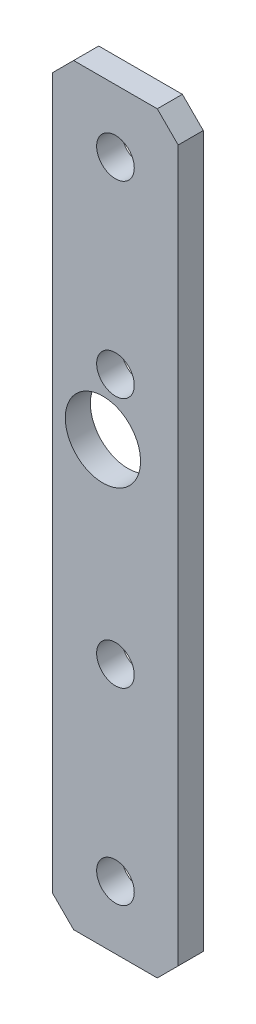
ISO-10303-21;
HEADER;
FILE_DESCRIPTION(('STEP AP214'),'2;1');
FILE_NAME('part.step','',(''),(''),'','','');
FILE_SCHEMA(('AUTOMOTIVE_DESIGN { 1 0 10303 214 1 1 1 1 }'));
ENDSEC;
DATA;
#1=APPLICATION_CONTEXT('core data for automotive mechanical design processes');
#2=APPLICATION_PROTOCOL_DEFINITION('international standard','automotive_design',2000,#1);
#3=PRODUCT_CONTEXT('',#1,'mechanical');
#4=PRODUCT('Part','Part','',(#3));
#5=PRODUCT_RELATED_PRODUCT_CATEGORY('part','',(#4));
#6=PRODUCT_DEFINITION_FORMATION('','',#4);
#7=PRODUCT_DEFINITION_CONTEXT('part definition',#1,'design');
#8=PRODUCT_DEFINITION('design','',#6,#7);
#9=PRODUCT_DEFINITION_SHAPE('','',#8);
#10=(LENGTH_UNIT() NAMED_UNIT(*) SI_UNIT(.MILLI.,.METRE.));
#11=(NAMED_UNIT(*) PLANE_ANGLE_UNIT() SI_UNIT($,.RADIAN.));
#12=(NAMED_UNIT(*) SI_UNIT($,.STERADIAN.) SOLID_ANGLE_UNIT());
#13=UNCERTAINTY_MEASURE_WITH_UNIT(LENGTH_MEASURE(1.E-05),#10,'distance_accuracy_value','');
#14=(GEOMETRIC_REPRESENTATION_CONTEXT(3) GLOBAL_UNCERTAINTY_ASSIGNED_CONTEXT((#13)) GLOBAL_UNIT_ASSIGNED_CONTEXT((#10,
#11,#12)) REPRESENTATION_CONTEXT('',''));
#15=CARTESIAN_POINT('',(0.,0.,0.));
#16=DIRECTION('',(0.,0.,1.));
#17=DIRECTION('',(1.,0.,0.));
#18=AXIS2_PLACEMENT_3D('',#15,#16,#17);
#19=CARTESIAN_POINT('',(0.,0.,0.));
#20=DIRECTION('',(0.,0.,1.));
#21=DIRECTION('',(1.,0.,0.));
#22=AXIS2_PLACEMENT_3D('',#19,#20,#21);
#23=PLANE('',#22);
#24=DIRECTION('',(0.707106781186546,-0.707106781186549,0.));
#25=VECTOR('',#24,1.);
#26=CARTESIAN_POINT('',(9.99999999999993,66.7961225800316,0.));
#27=LINE('',#26,#25);
#28=CARTESIAN_POINT('',(9.99999999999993,66.7961225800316,0.));
#29=VERTEX_POINT('',#28);
#30=CARTESIAN_POINT('',(15.,61.7961225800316,0.));
#31=VERTEX_POINT('',#30);
#32=EDGE_CURVE('E84',#29,#31,#27,.T.);
#33=ORIENTED_EDGE('',*,*,#32,.T.);
#34=DIRECTION('',(0.,1.,0.));
#35=VECTOR('',#34,1.);
#36=CARTESIAN_POINT('',(14.9999999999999,-113.203877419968,0.));
#37=LINE('',#36,#35);
#38=CARTESIAN_POINT('',(14.9999999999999,-108.203877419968,0.));
#39=VERTEX_POINT('',#38);
#40=EDGE_CURVE('E87',#31,#39,#37,.F.);
#41=ORIENTED_EDGE('',*,*,#40,.T.);
#42=DIRECTION('',(-0.707106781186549,-0.707106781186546,0.));
#43=VECTOR('',#42,1.);
#44=CARTESIAN_POINT('',(14.9999999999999,-108.203877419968,0.));
#45=LINE('',#44,#43);
#46=CARTESIAN_POINT('',(9.9999999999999,-113.203877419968,0.));
#47=VERTEX_POINT('',#46);
#48=EDGE_CURVE('E305',#39,#47,#45,.T.);
#49=ORIENTED_EDGE('',*,*,#48,.T.);
#50=DIRECTION('',(1.,0.,0.));
#51=VECTOR('',#50,1.);
#52=CARTESIAN_POINT('',(14.9999999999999,-113.203877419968,0.));
#53=LINE('',#52,#51);
#54=CARTESIAN_POINT('',(-10.,-113.203877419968,0.));
#55=VERTEX_POINT('',#54);
#56=EDGE_CURVE('E300',#47,#55,#53,.F.);
#57=ORIENTED_EDGE('',*,*,#56,.T.);
#58=DIRECTION('',(-0.707106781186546,0.707106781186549,0.));
#59=VECTOR('',#58,1.);
#60=CARTESIAN_POINT('',(-10.,-113.203877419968,0.));
#61=LINE('',#60,#59);
#62=CARTESIAN_POINT('',(-15.,-108.203877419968,0.));
#63=VERTEX_POINT('',#62);
#64=EDGE_CURVE('E296',#55,#63,#61,.T.);
#65=ORIENTED_EDGE('',*,*,#64,.T.);
#66=DIRECTION('',(0.,1.,0.));
#67=VECTOR('',#66,1.);
#68=CARTESIAN_POINT('',(-15.,66.7961225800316,0.));
#69=LINE('',#68,#67);
#70=CARTESIAN_POINT('',(-15.,61.7961225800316,0.));
#71=VERTEX_POINT('',#70);
#72=EDGE_CURVE('E292',#63,#71,#69,.T.);
#73=ORIENTED_EDGE('',*,*,#72,.T.);
#74=DIRECTION('',(0.707106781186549,0.707106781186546,0.));
#75=VECTOR('',#74,1.);
#76=CARTESIAN_POINT('',(-15.,61.7961225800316,0.));
#77=LINE('',#76,#75);
#78=CARTESIAN_POINT('',(-9.99999999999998,66.7961225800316,0.));
#79=VERTEX_POINT('',#78);
#80=EDGE_CURVE('E287',#71,#79,#77,.T.);
#81=ORIENTED_EDGE('',*,*,#80,.T.);
#82=DIRECTION('',(1.,0.,0.));
#83=VECTOR('',#82,1.);
#84=CARTESIAN_POINT('',(14.9999999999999,66.7961225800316,0.));
#85=LINE('',#84,#83);
#86=EDGE_CURVE('E82',#79,#29,#85,.T.);
#87=ORIENTED_EDGE('',*,*,#86,.T.);
#88=EDGE_LOOP('',(#33,#41,#49,#57,#65,#73,#81,#87));
#89=FACE_BOUND('',#88,.T.);
#90=CARTESIAN_POINT('',(0.,-98.2038774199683,0.));
#91=DIRECTION('',(0.,0.,1.));
#92=DIRECTION('',(1.,0.,0.));
#93=AXIS2_PLACEMENT_3D('',#90,#91,#92);
#94=CIRCLE('',#93,4.5);
#95=CARTESIAN_POINT('',(4.49999999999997,-98.2038774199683,0.));
#96=VERTEX_POINT('',#95);
#97=EDGE_CURVE('E100',#96,#96,#94,.T.);
#98=ORIENTED_EDGE('',*,*,#97,.T.);
#99=EDGE_LOOP('',(#98));
#100=FACE_BOUND('',#99,.T.);
#101=CARTESIAN_POINT('',(0.,51.7961225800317,0.));
#102=DIRECTION('',(0.,0.,1.));
#103=DIRECTION('',(1.,0.,0.));
#104=AXIS2_PLACEMENT_3D('',#101,#102,#103);
#105=CIRCLE('',#104,4.5);
#106=CARTESIAN_POINT('',(4.5,51.7961225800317,0.));
#107=VERTEX_POINT('',#106);
#108=EDGE_CURVE('E129',#107,#107,#105,.T.);
#109=ORIENTED_EDGE('',*,*,#108,.T.);
#110=EDGE_LOOP('',(#109));
#111=FACE_BOUND('',#110,.T.);
#112=CARTESIAN_POINT('',(0.,-53.2038774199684,0.));
#113=DIRECTION('',(0.,0.,-1.));
#114=DIRECTION('',(-1.,0.,0.));
#115=AXIS2_PLACEMENT_3D('',#112,#113,#114);
#116=CIRCLE('',#115,4.5);
#117=CARTESIAN_POINT('',(-4.5,-53.2038774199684,0.));
#118=VERTEX_POINT('',#117);
#119=EDGE_CURVE('E132',#118,#118,#116,.F.);
#120=ORIENTED_EDGE('',*,*,#119,.T.);
#121=EDGE_LOOP('',(#120));
#122=FACE_BOUND('',#121,.T.);
#123=CARTESIAN_POINT('',(0.,6.7961225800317,0.));
#124=DIRECTION('',(0.,0.,-1.));
#125=DIRECTION('',(-1.,0.,0.));
#126=AXIS2_PLACEMENT_3D('',#123,#124,#125);
#127=CIRCLE('',#126,4.5);
#128=CARTESIAN_POINT('',(-4.5,6.7961225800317,0.));
#129=VERTEX_POINT('',#128);
#130=EDGE_CURVE('E134',#129,#129,#127,.F.);
#131=ORIENTED_EDGE('',*,*,#130,.T.);
#132=EDGE_LOOP('',(#131));
#133=FACE_BOUND('',#132,.T.);
#134=CARTESIAN_POINT('',(-3.00000000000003,-8.20387741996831,0.));
#135=DIRECTION('',(0.,0.,-1.));
#136=DIRECTION('',(-1.,0.,0.));
#137=AXIS2_PLACEMENT_3D('',#134,#135,#136);
#138=CIRCLE('',#137,9.00000000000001);
#139=CARTESIAN_POINT('',(-12.,-8.20387741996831,0.));
#140=VERTEX_POINT('',#139);
#141=EDGE_CURVE('E22',#140,#140,#138,.F.);
#142=ORIENTED_EDGE('',*,*,#141,.T.);
#143=EDGE_LOOP('',(#142));
#144=FACE_BOUND('',#143,.T.);
#145=ADVANCED_FACE('F19',(#89,#100,#111,#122,#133,#144),#23,.F.);
#146=CARTESIAN_POINT('',(-3.,-8.20387741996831,9.99999999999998));
#147=DIRECTION('',(0.,0.,-1.));
#148=DIRECTION('',(-1.,0.,0.));
#149=AXIS2_PLACEMENT_3D('',#146,#147,#148);
#150=CYLINDRICAL_SURFACE('',#149,9.00000000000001);
#151=CARTESIAN_POINT('',(-3.,-8.20387741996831,6.00000000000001));
#152=DIRECTION('',(0.,0.,-1.));
#153=DIRECTION('',(-1.,0.,0.));
#154=AXIS2_PLACEMENT_3D('',#151,#152,#153);
#155=CIRCLE('',#154,9.00000000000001);
#156=CARTESIAN_POINT('',(-12.,-8.20387741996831,6.00000000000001));
#157=VERTEX_POINT('',#156);
#158=EDGE_CURVE('E124',#157,#157,#155,.T.);
#159=ORIENTED_EDGE('',*,*,#158,.F.);
#160=EDGE_LOOP('',(#159));
#161=FACE_BOUND('',#160,.T.);
#162=ORIENTED_EDGE('',*,*,#141,.F.);
#163=EDGE_LOOP('',(#162));
#164=FACE_BOUND('',#163,.T.);
#165=ADVANCED_FACE('F142',(#161,#164),#150,.F.);
#166=CARTESIAN_POINT('',(0.,6.7961225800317,9.99999999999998));
#167=DIRECTION('',(0.,0.,-1.));
#168=DIRECTION('',(-1.,0.,0.));
#169=AXIS2_PLACEMENT_3D('',#166,#167,#168);
#170=CYLINDRICAL_SURFACE('',#169,4.5);
#171=CARTESIAN_POINT('',(0.,6.7961225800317,5.99999999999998));
#172=DIRECTION('',(0.,0.,-1.));
#173=DIRECTION('',(-1.,0.,0.));
#174=AXIS2_PLACEMENT_3D('',#171,#172,#173);
#175=CIRCLE('',#174,4.5);
#176=CARTESIAN_POINT('',(-4.5,6.7961225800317,5.99999999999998));
#177=VERTEX_POINT('',#176);
#178=EDGE_CURVE('E121',#177,#177,#175,.T.);
#179=ORIENTED_EDGE('',*,*,#178,.F.);
#180=EDGE_LOOP('',(#179));
#181=FACE_BOUND('',#180,.T.);
#182=ORIENTED_EDGE('',*,*,#130,.F.);
#183=EDGE_LOOP('',(#182));
#184=FACE_BOUND('',#183,.T.);
#185=ADVANCED_FACE('F144',(#181,#184),#170,.F.);
#186=CARTESIAN_POINT('',(0.,-53.2038774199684,9.99999999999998));
#187=DIRECTION('',(0.,0.,-1.));
#188=DIRECTION('',(-1.,0.,0.));
#189=AXIS2_PLACEMENT_3D('',#186,#187,#188);
#190=CYLINDRICAL_SURFACE('',#189,4.5);
#191=CARTESIAN_POINT('',(0.,-53.2038774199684,5.99999999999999));
#192=DIRECTION('',(0.,0.,-1.));
#193=DIRECTION('',(-1.,0.,0.));
#194=AXIS2_PLACEMENT_3D('',#191,#192,#193);
#195=CIRCLE('',#194,4.5);
#196=CARTESIAN_POINT('',(-4.5,-53.2038774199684,5.99999999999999));
#197=VERTEX_POINT('',#196);
#198=EDGE_CURVE('E118',#197,#197,#195,.T.);
#199=ORIENTED_EDGE('',*,*,#198,.F.);
#200=EDGE_LOOP('',(#199));
#201=FACE_BOUND('',#200,.T.);
#202=ORIENTED_EDGE('',*,*,#119,.F.);
#203=EDGE_LOOP('',(#202));
#204=FACE_BOUND('',#203,.T.);
#205=ADVANCED_FACE('F151',(#201,#204),#190,.F.);
#206=CARTESIAN_POINT('',(0.,51.7961225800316,5.99999999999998));
#207=DIRECTION('',(0.,0.,1.));
#208=DIRECTION('',(1.,0.,0.));
#209=AXIS2_PLACEMENT_3D('',#206,#207,#208);
#210=CYLINDRICAL_SURFACE('',#209,4.5);
#211=CARTESIAN_POINT('',(0.,51.7961225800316,5.99999999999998));
#212=DIRECTION('',(0.,0.,1.));
#213=DIRECTION('',(1.,0.,0.));
#214=AXIS2_PLACEMENT_3D('',#211,#212,#213);
#215=CIRCLE('',#214,4.5);
#216=CARTESIAN_POINT('',(4.5,51.7961225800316,5.99999999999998));
#217=VERTEX_POINT('',#216);
#218=EDGE_CURVE('E115',#217,#217,#215,.F.);
#219=ORIENTED_EDGE('',*,*,#218,.F.);
#220=EDGE_LOOP('',(#219));
#221=FACE_BOUND('',#220,.T.);
#222=ORIENTED_EDGE('',*,*,#108,.F.);
#223=EDGE_LOOP('',(#222));
#224=FACE_BOUND('',#223,.T.);
#225=ADVANCED_FACE('F194',(#221,#224),#210,.F.);
#226=CARTESIAN_POINT('',(0.,-98.2038774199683,6.00000000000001));
#227=DIRECTION('',(0.,0.,1.));
#228=DIRECTION('',(1.,0.,0.));
#229=AXIS2_PLACEMENT_3D('',#226,#227,#228);
#230=CYLINDRICAL_SURFACE('',#229,4.5);
#231=CARTESIAN_POINT('',(0.,-98.2038774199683,6.00000000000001));
#232=DIRECTION('',(0.,0.,1.));
#233=DIRECTION('',(1.,0.,0.));
#234=AXIS2_PLACEMENT_3D('',#231,#232,#233);
#235=CIRCLE('',#234,4.5);
#236=CARTESIAN_POINT('',(4.5,-98.2038774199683,6.00000000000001));
#237=VERTEX_POINT('',#236);
#238=EDGE_CURVE('E111',#237,#237,#235,.F.);
#239=ORIENTED_EDGE('',*,*,#238,.F.);
#240=EDGE_LOOP('',(#239));
#241=FACE_BOUND('',#240,.T.);
#242=ORIENTED_EDGE('',*,*,#97,.F.);
#243=EDGE_LOOP('',(#242));
#244=FACE_BOUND('',#243,.T.);
#245=ADVANCED_FACE('F191',(#241,#244),#230,.F.);
#246=CARTESIAN_POINT('',(15.,-113.203877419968,5.99999999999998));
#247=DIRECTION('',(-1.,0.,0.));
#248=DIRECTION('',(0.,0.,1.));
#249=AXIS2_PLACEMENT_3D('',#246,#247,#248);
#250=PLANE('',#249);
#251=DIRECTION('',(0.,0.,1.));
#252=VECTOR('',#251,1.);
#253=CARTESIAN_POINT('',(14.9999999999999,61.7961225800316,5.99999999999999));
#254=LINE('',#253,#252);
#255=CARTESIAN_POINT('',(14.9999999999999,61.7961225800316,5.99999999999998));
#256=VERTEX_POINT('',#255);
#257=EDGE_CURVE('E92',#31,#256,#254,.T.);
#258=ORIENTED_EDGE('',*,*,#257,.T.);
#259=DIRECTION('',(0.,1.,0.));
#260=VECTOR('',#259,1.);
#261=CARTESIAN_POINT('',(14.9999999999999,0.,5.99999999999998));
#262=LINE('',#261,#260);
#263=CARTESIAN_POINT('',(15.,-108.203877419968,5.99999999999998));
#264=VERTEX_POINT('',#263);
#265=EDGE_CURVE('E114',#264,#256,#262,.T.);
#266=ORIENTED_EDGE('',*,*,#265,.F.);
#267=DIRECTION('',(0.,0.,1.));
#268=VECTOR('',#267,1.);
#269=CARTESIAN_POINT('',(14.9999999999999,-108.203877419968,5.99999999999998));
#270=LINE('',#269,#268);
#271=EDGE_CURVE('E98',#264,#39,#270,.F.);
#272=ORIENTED_EDGE('',*,*,#271,.T.);
#273=ORIENTED_EDGE('',*,*,#40,.F.);
#274=EDGE_LOOP('',(#258,#266,#272,#273));
#275=FACE_BOUND('',#274,.T.);
#276=ADVANCED_FACE('F95',(#275),#250,.F.);
#277=CARTESIAN_POINT('',(9.99999999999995,66.7961225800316,5.99999999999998));
#278=DIRECTION('',(-0.707106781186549,-0.707106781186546,0.));
#279=DIRECTION('',(0.707106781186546,-0.707106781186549,0.));
#280=AXIS2_PLACEMENT_3D('',#277,#278,#279);
#281=PLANE('',#280);
#282=ORIENTED_EDGE('',*,*,#257,.F.);
#283=ORIENTED_EDGE('',*,*,#32,.F.);
#284=DIRECTION('',(0.,0.,-1.));
#285=VECTOR('',#284,1.);
#286=CARTESIAN_POINT('',(9.99999999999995,66.7961225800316,5.99999999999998));
#287=LINE('',#286,#285);
#288=CARTESIAN_POINT('',(9.99999999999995,66.7961225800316,5.99999999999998));
#289=VERTEX_POINT('',#288);
#290=EDGE_CURVE('E107',#29,#289,#287,.F.);
#291=ORIENTED_EDGE('',*,*,#290,.T.);
#292=DIRECTION('',(-0.707106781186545,0.70710678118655,0.));
#293=VECTOR('',#292,1.);
#294=CARTESIAN_POINT('',(14.9999999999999,61.7961225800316,5.99999999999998));
#295=LINE('',#294,#293);
#296=EDGE_CURVE('E104',#256,#289,#295,.T.);
#297=ORIENTED_EDGE('',*,*,#296,.F.);
#298=EDGE_LOOP('',(#282,#283,#291,#297));
#299=FACE_BOUND('',#298,.T.);
#300=ADVANCED_FACE('F102',(#299),#281,.F.);
#301=CARTESIAN_POINT('',(14.9999999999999,66.7961225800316,5.99999999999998));
#302=DIRECTION('',(0.,-1.,0.));
#303=DIRECTION('',(0.,0.,-1.));
#304=AXIS2_PLACEMENT_3D('',#301,#302,#303);
#305=PLANE('',#304);
#306=ORIENTED_EDGE('',*,*,#290,.F.);
#307=ORIENTED_EDGE('',*,*,#86,.F.);
#308=DIRECTION('',(0.,0.,1.));
#309=VECTOR('',#308,1.);
#310=CARTESIAN_POINT('',(-10.,66.7961225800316,5.99999999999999));
#311=LINE('',#310,#309);
#312=CARTESIAN_POINT('',(-10.,66.7961225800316,5.99999999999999));
#313=VERTEX_POINT('',#312);
#314=EDGE_CURVE('E288',#79,#313,#311,.T.);
#315=ORIENTED_EDGE('',*,*,#314,.T.);
#316=DIRECTION('',(1.,0.,0.));
#317=VECTOR('',#316,1.);
#318=CARTESIAN_POINT('',(0.,66.7961225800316,5.99999999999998));
#319=LINE('',#318,#317);
#320=EDGE_CURVE('E286',#289,#313,#319,.F.);
#321=ORIENTED_EDGE('',*,*,#320,.F.);
#322=EDGE_LOOP('',(#306,#307,#315,#321));
#323=FACE_BOUND('',#322,.T.);
#324=ADVANCED_FACE('F182',(#323),#305,.F.);
#325=CARTESIAN_POINT('',(-15.0000000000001,61.7961225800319,5.99999999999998));
#326=DIRECTION('',(0.707106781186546,-0.707106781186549,0.));
#327=DIRECTION('',(0.707106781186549,0.707106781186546,0.));
#328=AXIS2_PLACEMENT_3D('',#325,#326,#327);
#329=PLANE('',#328);
#330=ORIENTED_EDGE('',*,*,#314,.F.);
#331=ORIENTED_EDGE('',*,*,#80,.F.);
#332=DIRECTION('',(0.,0.,1.));
#333=VECTOR('',#332,1.);
#334=CARTESIAN_POINT('',(-15.0000000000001,61.7961225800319,5.99999999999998));
#335=LINE('',#334,#333);
#336=CARTESIAN_POINT('',(-15.0000000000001,61.7961225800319,5.99999999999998));
#337=VERTEX_POINT('',#336);
#338=EDGE_CURVE('E294',#71,#337,#335,.T.);
#339=ORIENTED_EDGE('',*,*,#338,.T.);
#340=DIRECTION('',(-0.707106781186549,-0.707106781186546,0.));
#341=VECTOR('',#340,1.);
#342=CARTESIAN_POINT('',(-10.,66.7961225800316,5.99999999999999));
#343=LINE('',#342,#341);
#344=EDGE_CURVE('E311',#313,#337,#343,.T.);
#345=ORIENTED_EDGE('',*,*,#344,.F.);
#346=EDGE_LOOP('',(#330,#331,#339,#345));
#347=FACE_BOUND('',#346,.T.);
#348=ADVANCED_FACE('F178',(#347),#329,.F.);
#349=CARTESIAN_POINT('',(-15.0000000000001,66.7961225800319,5.99999999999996));
#350=DIRECTION('',(1.,0.,0.));
#351=DIRECTION('',(0.,1.,0.));
#352=AXIS2_PLACEMENT_3D('',#349,#350,#351);
#353=PLANE('',#352);
#354=ORIENTED_EDGE('',*,*,#338,.F.);
#355=ORIENTED_EDGE('',*,*,#72,.F.);
#356=DIRECTION('',(0.,0.,1.));
#357=VECTOR('',#356,1.);
#358=CARTESIAN_POINT('',(-15.,-108.203877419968,5.99999999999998));
#359=LINE('',#358,#357);
#360=CARTESIAN_POINT('',(-15.,-108.203877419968,5.99999999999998));
#361=VERTEX_POINT('',#360);
#362=EDGE_CURVE('E298',#63,#361,#359,.T.);
#363=ORIENTED_EDGE('',*,*,#362,.T.);
#364=DIRECTION('',(0.,1.,0.));
#365=VECTOR('',#364,1.);
#366=CARTESIAN_POINT('',(-15.,2.22044604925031E-13,6.00000000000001));
#367=LINE('',#366,#365);
#368=EDGE_CURVE('E314',#337,#361,#367,.F.);
#369=ORIENTED_EDGE('',*,*,#368,.F.);
#370=EDGE_LOOP('',(#354,#355,#363,#369));
#371=FACE_BOUND('',#370,.T.);
#372=ADVANCED_FACE('F174',(#371),#353,.F.);
#373=CARTESIAN_POINT('',(-10.,-113.203877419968,5.99999999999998));
#374=DIRECTION('',(0.70710678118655,0.707106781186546,0.));
#375=DIRECTION('',(-0.707106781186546,0.707106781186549,0.));
#376=AXIS2_PLACEMENT_3D('',#373,#374,#375);
#377=PLANE('',#376);
#378=ORIENTED_EDGE('',*,*,#362,.F.);
#379=ORIENTED_EDGE('',*,*,#64,.F.);
#380=DIRECTION('',(0.,0.,1.));
#381=VECTOR('',#380,1.);
#382=CARTESIAN_POINT('',(-10.,-113.203877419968,5.99999999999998));
#383=LINE('',#382,#381);
#384=CARTESIAN_POINT('',(-10.,-113.203877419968,5.99999999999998));
#385=VERTEX_POINT('',#384);
#386=EDGE_CURVE('E302',#55,#385,#383,.T.);
#387=ORIENTED_EDGE('',*,*,#386,.T.);
#388=DIRECTION('',(0.707106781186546,-0.707106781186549,0.));
#389=VECTOR('',#388,1.);
#390=CARTESIAN_POINT('',(-15.,-108.203877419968,5.99999999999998));
#391=LINE('',#390,#389);
#392=EDGE_CURVE('E317',#361,#385,#391,.T.);
#393=ORIENTED_EDGE('',*,*,#392,.F.);
#394=EDGE_LOOP('',(#378,#379,#387,#393));
#395=FACE_BOUND('',#394,.T.);
#396=ADVANCED_FACE('F171',(#395),#377,.F.);
#397=CARTESIAN_POINT('',(15.,-113.203877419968,5.99999999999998));
#398=DIRECTION('',(0.,1.,0.));
#399=DIRECTION('',(0.,0.,1.));
#400=AXIS2_PLACEMENT_3D('',#397,#398,#399);
#401=PLANE('',#400);
#402=ORIENTED_EDGE('',*,*,#386,.F.);
#403=ORIENTED_EDGE('',*,*,#56,.F.);
#404=DIRECTION('',(0.,0.,1.));
#405=VECTOR('',#404,1.);
#406=CARTESIAN_POINT('',(9.99999999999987,-113.203877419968,5.99999999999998));
#407=LINE('',#406,#405);
#408=CARTESIAN_POINT('',(9.99999999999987,-113.203877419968,5.99999999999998));
#409=VERTEX_POINT('',#408);
#410=EDGE_CURVE('E37',#47,#409,#407,.T.);
#411=ORIENTED_EDGE('',*,*,#410,.T.);
#412=DIRECTION('',(1.,0.,0.));
#413=VECTOR('',#412,1.);
#414=CARTESIAN_POINT('',(0.,-113.203877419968,6.00000000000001));
#415=LINE('',#414,#413);
#416=EDGE_CURVE('E28',#385,#409,#415,.T.);
#417=ORIENTED_EDGE('',*,*,#416,.F.);
#418=EDGE_LOOP('',(#402,#403,#411,#417));
#419=FACE_BOUND('',#418,.T.);
#420=ADVANCED_FACE('F163',(#419),#401,.F.);
#421=CARTESIAN_POINT('',(15.,-108.203877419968,5.99999999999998));
#422=DIRECTION('',(-0.707106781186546,0.707106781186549,0.));
#423=DIRECTION('',(-0.707106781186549,-0.707106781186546,0.));
#424=AXIS2_PLACEMENT_3D('',#421,#422,#423);
#425=PLANE('',#424);
#426=ORIENTED_EDGE('',*,*,#410,.F.);
#427=ORIENTED_EDGE('',*,*,#48,.F.);
#428=ORIENTED_EDGE('',*,*,#271,.F.);
#429=DIRECTION('',(0.70710678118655,0.707106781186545,0.));
#430=VECTOR('',#429,1.);
#431=CARTESIAN_POINT('',(9.99999999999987,-113.203877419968,5.99999999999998));
#432=LINE('',#431,#430);
#433=EDGE_CURVE('E11',#409,#264,#432,.T.);
#434=ORIENTED_EDGE('',*,*,#433,.F.);
#435=EDGE_LOOP('',(#426,#427,#428,#434));
#436=FACE_BOUND('',#435,.T.);
#437=ADVANCED_FACE('F157',(#436),#425,.F.);
#438=CARTESIAN_POINT('',(0.,0.,5.99999999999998));
#439=DIRECTION('',(0.,0.,1.));
#440=DIRECTION('',(1.,0.,0.));
#441=AXIS2_PLACEMENT_3D('',#438,#439,#440);
#442=PLANE('',#441);
#443=ORIENTED_EDGE('',*,*,#416,.T.);
#444=ORIENTED_EDGE('',*,*,#433,.T.);
#445=ORIENTED_EDGE('',*,*,#265,.T.);
#446=ORIENTED_EDGE('',*,*,#296,.T.);
#447=ORIENTED_EDGE('',*,*,#320,.T.);
#448=ORIENTED_EDGE('',*,*,#344,.T.);
#449=ORIENTED_EDGE('',*,*,#368,.T.);
#450=ORIENTED_EDGE('',*,*,#392,.T.);
#451=EDGE_LOOP('',(#443,#444,#445,#446,#447,#448,#449,#450));
#452=FACE_BOUND('',#451,.T.);
#453=ORIENTED_EDGE('',*,*,#238,.T.);
#454=EDGE_LOOP('',(#453));
#455=FACE_BOUND('',#454,.T.);
#456=ORIENTED_EDGE('',*,*,#218,.T.);
#457=EDGE_LOOP('',(#456));
#458=FACE_BOUND('',#457,.T.);
#459=ORIENTED_EDGE('',*,*,#198,.T.);
#460=EDGE_LOOP('',(#459));
#461=FACE_BOUND('',#460,.T.);
#462=ORIENTED_EDGE('',*,*,#178,.T.);
#463=EDGE_LOOP('',(#462));
#464=FACE_BOUND('',#463,.T.);
#465=ORIENTED_EDGE('',*,*,#158,.T.);
#466=EDGE_LOOP('',(#465));
#467=FACE_BOUND('',#466,.T.);
#468=ADVANCED_FACE('F155',(#452,#455,#458,#461,#464,#467),#442,.T.);
#469=CLOSED_SHELL('',(#145,#165,#185,#205,#225,#245,#276,#300,#324,#348,#372,#396,#420,#437,#468));
#470=MANIFOLD_SOLID_BREP('B1',#469);
#471=ADVANCED_BREP_SHAPE_REPRESENTATION('',(#18,#470),#14);
#472=SHAPE_DEFINITION_REPRESENTATION(#9,#471);
ENDSEC;
END-ISO-10303-21;
